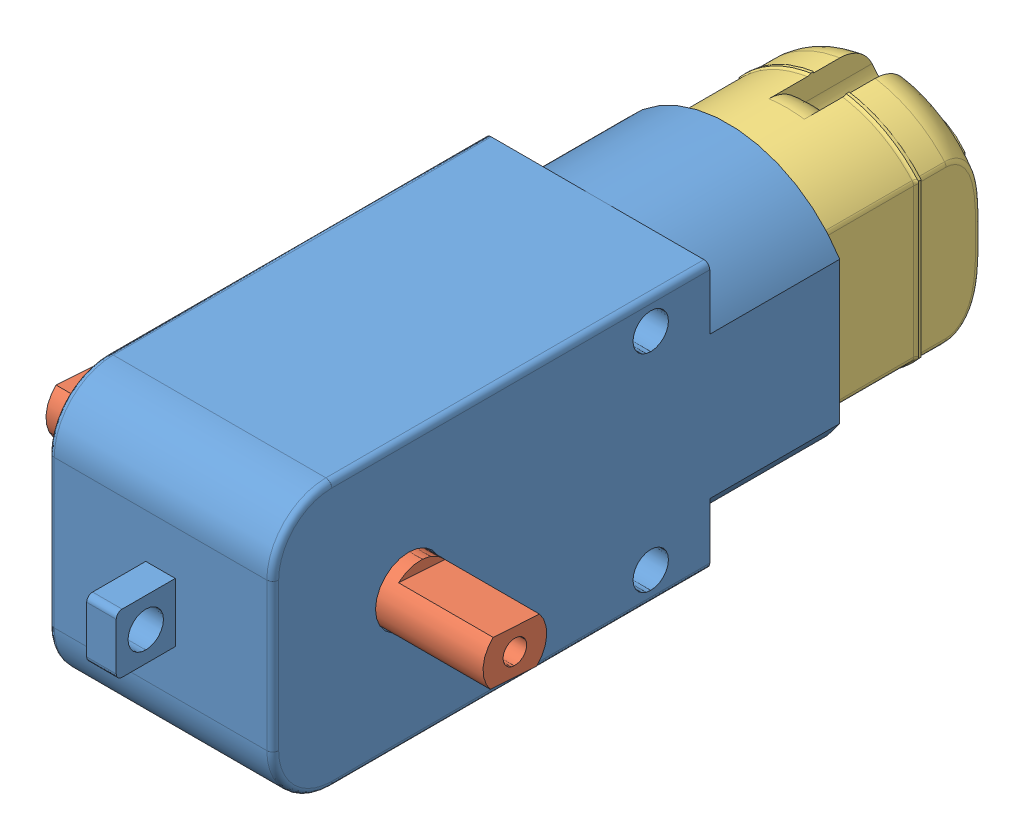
SolidWorks assembly DC Motor Gearbox.STEP.SLDASM, configuration Default (file format 14000). Lengths in mm.
Overall size (37 22.5 70).
3 component instances, 3 part files, 0 mates.
Components (placement in the parent):
- Gearbox.STEP-1: Gearbox.STEP.SLDPRT [Default] at (19.5167 31.236 22.8921) size (19 22.5 53)
- output shaft.STEP-1: output shaft.STEP.SLDPRT [Default] at (19.5167 31.236 48.3921) x (1 0 0) z (0 -0.997873 0.065186) size (37 5.4 5.4)
- motor.STEP-1: motor.STEP.SLDPRT [Default] at (19.5167 31.236 -2.1079) size (19.83 19.8 37.8)
